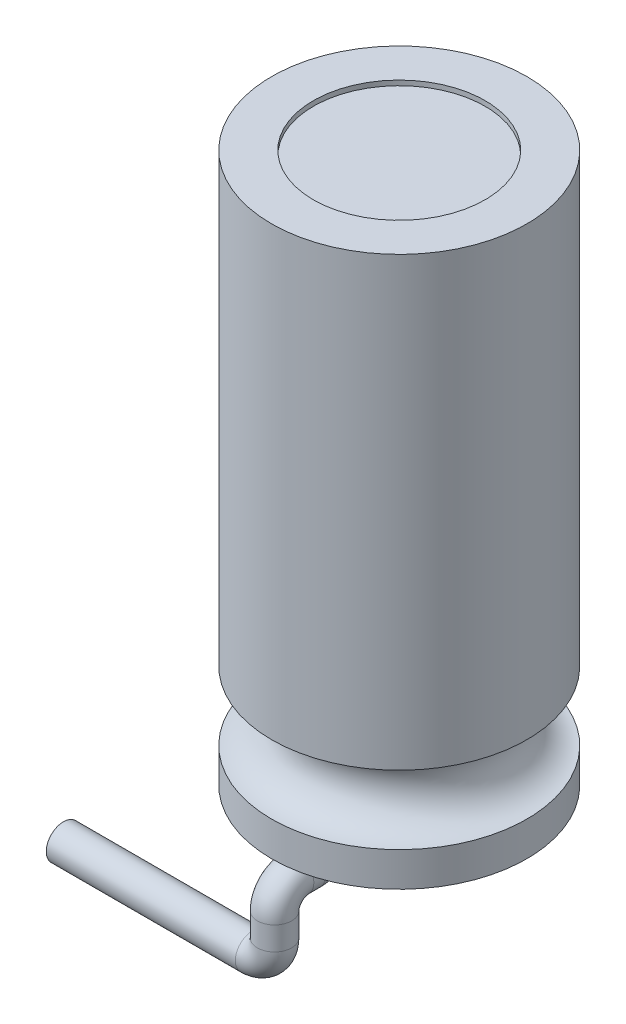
from build123d import *

# Parameters (mm, degrees)
ESQUISSE2_R             = 1.75
ENL_V_MAT_EXTRU_1_DEPTH = 0.1
ESQUISSE3_R             = 0.35
ESQUISSE7_R             = 0.35


with BuildPart() as part:
    # Esquisse1 → R_volution1 (revolve)
    with BuildSketch(Plane.XY, mode=Mode.PRIVATE) as r_volution1_sk:
        with BuildLine():
            Line((0, 38.716423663), (2.6, 38.716423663))
            Line((2.6, 38.716423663), (2.6, 29.616423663))
            ThreePointArc((2.6, 29.616423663), (1.9, 28.916423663), (2.6, 28.216423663))
            Line((2.6, 28.216423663), (2.6, 27.516423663))
            Line((2.6, 27.516423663), (0, 27.516423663))
            Line((0, 27.516423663), (0, 38.716423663))
        make_face()
    revolve(r_volution1_sk.sketch.rotate(Axis((0, 48.401709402, 0), (0, -1, 0)), 90), axis=Axis((0, 48.401709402, 0), (0, -1, 0)))

    # Esquisse2 → Enl_v. mat.-Extru.1 (cut)
    with BuildSketch(Plane(origin=(0, 38.716423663, 0), x_dir=(-1, 0, 0), z_dir=(0, 1, 0))):
        with Locations(Location((0, 0, 0), (0, 0, 90))):
            Circle(ESQUISSE2_R)
    extrude(amount=-ENL_V_MAT_EXTRU_1_DEPTH, mode=Mode.SUBTRACT)

    # Balayage1: sweep along a path in Esquisse4
    with BuildLine(Plane(origin=(0, 0, 0), x_dir=(0, 0, -1), z_dir=(1, 0, 0))) as balayage1_path:
        Line((-2.54, 26.139829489), (-2.54, 26.566423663))
        ThreePointArc((-2.54, 26.566423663), (-2.408198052, 26.884621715), (-2.09, 27.016423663))
        Line((-2.09, 27.016423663), (-1.85, 27.016423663))
        ThreePointArc((-1.85, 27.016423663), (-1.531801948, 27.148225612), (-1.4, 27.466423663))
        Line((-1.4, 27.466423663), (-1.4, 27.516423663))
    # Esquisse3 → Balayage1 (sweep)
    with BuildSketch(Plane.XZ.offset(-27.516423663)):
        with Locations((0, 1.4)):
            Circle(ESQUISSE3_R)
    balayage1 = sweep(path=balayage1_path.line)

    # Balayage2: sweep along a path in Esquisse8
    with BuildLine(Plane.XY.offset(2.54)) as balayage2_path:
        Line((-4.3, 25.639829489), (-0.45, 25.639829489))
        ThreePointArc((-0.45, 25.639829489), (-0.131801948, 25.771631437), (0, 26.089829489))
        Line((0, 26.089829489), (0, 26.139829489))
    # Esquisse7 → Balayage2 (sweep)
    with BuildSketch(Plane.XZ.offset(-26.139829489)):
        with Locations((0, 2.54)):
            Circle(ESQUISSE7_R)
    balayage2 = sweep(path=balayage2_path.line)

    # Sym_trie1: Balayage1, Balayage2 across plane
    add(balayage1.mirror(Plane.XY))
    add(balayage2.mirror(Plane.XY))


solid = part.part
